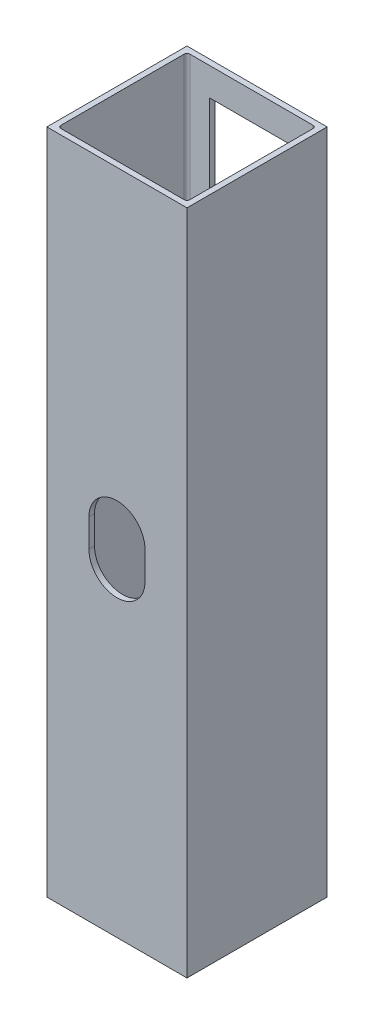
ISO-10303-21;
HEADER;
FILE_DESCRIPTION(('STEP AP214'),'2;1');
FILE_NAME('part.step','',(''),(''),'','','');
FILE_SCHEMA(('AUTOMOTIVE_DESIGN { 1 0 10303 214 1 1 1 1 }'));
ENDSEC;
DATA;
#1=APPLICATION_CONTEXT('core data for automotive mechanical design processes');
#2=APPLICATION_PROTOCOL_DEFINITION('international standard','automotive_design',2000,#1);
#3=PRODUCT_CONTEXT('',#1,'mechanical');
#4=PRODUCT('Part','Part','',(#3));
#5=PRODUCT_RELATED_PRODUCT_CATEGORY('part','',(#4));
#6=PRODUCT_DEFINITION_FORMATION('','',#4);
#7=PRODUCT_DEFINITION_CONTEXT('part definition',#1,'design');
#8=PRODUCT_DEFINITION('design','',#6,#7);
#9=PRODUCT_DEFINITION_SHAPE('','',#8);
#10=(LENGTH_UNIT() NAMED_UNIT(*) SI_UNIT(.MILLI.,.METRE.));
#11=(NAMED_UNIT(*) PLANE_ANGLE_UNIT() SI_UNIT($,.RADIAN.));
#12=(NAMED_UNIT(*) SI_UNIT($,.STERADIAN.) SOLID_ANGLE_UNIT());
#13=UNCERTAINTY_MEASURE_WITH_UNIT(LENGTH_MEASURE(1.E-05),#10,'distance_accuracy_value','');
#14=(GEOMETRIC_REPRESENTATION_CONTEXT(3) GLOBAL_UNCERTAINTY_ASSIGNED_CONTEXT((#13)) GLOBAL_UNIT_ASSIGNED_CONTEXT((#10,
#11,#12)) REPRESENTATION_CONTEXT('',''));
#15=CARTESIAN_POINT('',(0.,0.,0.));
#16=DIRECTION('',(0.,0.,1.));
#17=DIRECTION('',(1.,0.,0.));
#18=AXIS2_PLACEMENT_3D('',#15,#16,#17);
#19=CARTESIAN_POINT('',(0.,-304.8,0.));
#20=DIRECTION('',(0.,0.,1.));
#21=DIRECTION('',(1.,0.,0.));
#22=AXIS2_PLACEMENT_3D('',#19,#20,#21);
#23=PLANE('',#22);
#24=DIRECTION('',(1.,0.,0.));
#25=VECTOR('',#24,1.);
#26=CARTESIAN_POINT('',(0.,-2.54,0.));
#27=LINE('',#26,#25);
#28=CARTESIAN_POINT('',(0.,-2.5400000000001,0.));
#29=VERTEX_POINT('',#28);
#30=CARTESIAN_POINT('',(63.5,-2.54,0.));
#31=VERTEX_POINT('',#30);
#32=EDGE_CURVE('E281',#29,#31,#27,.T.);
#33=ORIENTED_EDGE('',*,*,#32,.F.);
#34=DIRECTION('',(0.,1.,0.));
#35=VECTOR('',#34,1.);
#36=CARTESIAN_POINT('',(0.,-304.8,0.));
#37=LINE('',#36,#35);
#38=CARTESIAN_POINT('',(0.,-304.8,0.));
#39=VERTEX_POINT('',#38);
#40=EDGE_CURVE('E333',#39,#29,#37,.T.);
#41=ORIENTED_EDGE('',*,*,#40,.F.);
#42=DIRECTION('',(1.,0.,0.));
#43=VECTOR('',#42,1.);
#44=CARTESIAN_POINT('',(0.,-304.8,0.));
#45=LINE('',#44,#43);
#46=CARTESIAN_POINT('',(63.5,-304.8,0.));
#47=VERTEX_POINT('',#46);
#48=EDGE_CURVE('E321',#39,#47,#45,.T.);
#49=ORIENTED_EDGE('',*,*,#48,.T.);
#50=DIRECTION('',(0.,1.,0.));
#51=VECTOR('',#50,1.);
#52=CARTESIAN_POINT('',(63.5,-304.8,0.));
#53=LINE('',#52,#51);
#54=EDGE_CURVE('E343',#47,#31,#53,.T.);
#55=ORIENTED_EDGE('',*,*,#54,.T.);
#56=EDGE_LOOP('',(#33,#41,#49,#55));
#57=FACE_BOUND('',#56,.T.);
#58=CARTESIAN_POINT('',(31.75,-146.05,0.));
#59=DIRECTION('',(0.,0.,1.));
#60=DIRECTION('',(1.,0.,0.));
#61=AXIS2_PLACEMENT_3D('',#58,#59,#60);
#62=CIRCLE('',#61,12.7);
#63=CARTESIAN_POINT('',(44.45,-146.05,0.));
#64=VERTEX_POINT('',#63);
#65=CARTESIAN_POINT('',(19.05,-146.05,0.));
#66=VERTEX_POINT('',#65);
#67=EDGE_CURVE('E228',#64,#66,#62,.T.);
#68=ORIENTED_EDGE('',*,*,#67,.F.);
#69=DIRECTION('',(0.,-1.,0.));
#70=VECTOR('',#69,1.);
#71=CARTESIAN_POINT('',(44.45,0.,0.));
#72=LINE('',#71,#70);
#73=CARTESIAN_POINT('',(44.45,-158.75,0.));
#74=VERTEX_POINT('',#73);
#75=EDGE_CURVE('E255',#64,#74,#72,.T.);
#76=ORIENTED_EDGE('',*,*,#75,.T.);
#77=CARTESIAN_POINT('',(31.75,-158.75,0.));
#78=DIRECTION('',(0.,0.,1.));
#79=DIRECTION('',(1.,0.,0.));
#80=AXIS2_PLACEMENT_3D('',#77,#78,#79);
#81=CIRCLE('',#80,12.7);
#82=CARTESIAN_POINT('',(19.05,-158.75,0.));
#83=VERTEX_POINT('',#82);
#84=EDGE_CURVE('E266',#83,#74,#81,.T.);
#85=ORIENTED_EDGE('',*,*,#84,.F.);
#86=DIRECTION('',(0.,-1.,0.));
#87=VECTOR('',#86,1.);
#88=CARTESIAN_POINT('',(19.05,0.,0.));
#89=LINE('',#88,#87);
#90=EDGE_CURVE('E246',#66,#83,#89,.T.);
#91=ORIENTED_EDGE('',*,*,#90,.F.);
#92=EDGE_LOOP('',(#68,#76,#85,#91));
#93=FACE_BOUND('',#92,.T.);
#94=ADVANCED_FACE('F42',(#57,#93),#23,.T.);
#95=CARTESIAN_POINT('',(0.,-302.26,-2.54));
#96=DIRECTION('',(0.,0.,1.));
#97=DIRECTION('',(1.,0.,0.));
#98=AXIS2_PLACEMENT_3D('',#95,#96,#97);
#99=PLANE('',#98);
#100=DIRECTION('',(1.,0.,0.));
#101=VECTOR('',#100,1.);
#102=CARTESIAN_POINT('',(0.,-302.26,-2.54));
#103=LINE('',#102,#101);
#104=CARTESIAN_POINT('',(3.81,-302.26,-2.54));
#105=VERTEX_POINT('',#104);
#106=CARTESIAN_POINT('',(59.69,-302.26,-2.54));
#107=VERTEX_POINT('',#106);
#108=EDGE_CURVE('E301',#105,#107,#103,.T.);
#109=ORIENTED_EDGE('',*,*,#108,.F.);
#110=DIRECTION('',(0.,1.,0.));
#111=VECTOR('',#110,1.);
#112=CARTESIAN_POINT('',(3.81,-302.26,-2.54));
#113=LINE('',#112,#111);
#114=CARTESIAN_POINT('',(3.81,-2.53999999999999,-2.54));
#115=VERTEX_POINT('',#114);
#116=EDGE_CURVE('E355',#105,#115,#113,.T.);
#117=ORIENTED_EDGE('',*,*,#116,.T.);
#118=DIRECTION('',(1.,0.,0.));
#119=VECTOR('',#118,1.);
#120=CARTESIAN_POINT('',(0.,-2.53999999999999,-2.54));
#121=LINE('',#120,#119);
#122=CARTESIAN_POINT('',(59.69,-2.53999999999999,-2.54));
#123=VERTEX_POINT('',#122);
#124=EDGE_CURVE('E297',#115,#123,#121,.T.);
#125=ORIENTED_EDGE('',*,*,#124,.T.);
#126=DIRECTION('',(0.,1.,0.));
#127=VECTOR('',#126,1.);
#128=CARTESIAN_POINT('',(59.69,-302.26,-2.54));
#129=LINE('',#128,#127);
#130=EDGE_CURVE('E352',#123,#107,#129,.F.);
#131=ORIENTED_EDGE('',*,*,#130,.T.);
#132=EDGE_LOOP('',(#109,#117,#125,#131));
#133=FACE_BOUND('',#132,.T.);
#134=DIRECTION('',(0.,-1.,0.));
#135=VECTOR('',#134,1.);
#136=CARTESIAN_POINT('',(44.45,0.,-2.54));
#137=LINE('',#136,#135);
#138=CARTESIAN_POINT('',(44.45,-146.05,-2.54));
#139=VERTEX_POINT('',#138);
#140=CARTESIAN_POINT('',(44.45,-158.75,-2.54));
#141=VERTEX_POINT('',#140);
#142=EDGE_CURVE('E259',#139,#141,#137,.T.);
#143=ORIENTED_EDGE('',*,*,#142,.F.);
#144=CARTESIAN_POINT('',(31.75,-146.05,-2.54));
#145=DIRECTION('',(0.,0.,1.));
#146=DIRECTION('',(1.,0.,0.));
#147=AXIS2_PLACEMENT_3D('',#144,#145,#146);
#148=CIRCLE('',#147,12.7);
#149=CARTESIAN_POINT('',(19.05,-146.05,-2.54));
#150=VERTEX_POINT('',#149);
#151=EDGE_CURVE('E234',#139,#150,#148,.T.);
#152=ORIENTED_EDGE('',*,*,#151,.T.);
#153=DIRECTION('',(0.,-1.,0.));
#154=VECTOR('',#153,1.);
#155=CARTESIAN_POINT('',(19.05,0.,-2.54));
#156=LINE('',#155,#154);
#157=CARTESIAN_POINT('',(19.05,-158.75,-2.54));
#158=VERTEX_POINT('',#157);
#159=EDGE_CURVE('E250',#150,#158,#156,.T.);
#160=ORIENTED_EDGE('',*,*,#159,.T.);
#161=CARTESIAN_POINT('',(31.75,-158.75,-2.54));
#162=DIRECTION('',(0.,0.,1.));
#163=DIRECTION('',(1.,0.,0.));
#164=AXIS2_PLACEMENT_3D('',#161,#162,#163);
#165=CIRCLE('',#164,12.7);
#166=EDGE_CURVE('E254',#158,#141,#165,.T.);
#167=ORIENTED_EDGE('',*,*,#166,.T.);
#168=EDGE_LOOP('',(#143,#152,#160,#167));
#169=FACE_BOUND('',#168,.T.);
#170=ADVANCED_FACE('F421',(#133,#169),#99,.F.);
#171=CARTESIAN_POINT('',(0.,-304.8,0.));
#172=DIRECTION('',(-1.,0.,0.));
#173=DIRECTION('',(0.,0.,1.));
#174=AXIS2_PLACEMENT_3D('',#171,#172,#173);
#175=PLANE('',#174);
#176=DIRECTION('',(0.,0.,1.));
#177=VECTOR('',#176,1.);
#178=CARTESIAN_POINT('',(0.,-2.54,0.));
#179=LINE('',#178,#177);
#180=CARTESIAN_POINT('',(0.,-2.54,-63.5));
#181=VERTEX_POINT('',#180);
#182=EDGE_CURVE('E276',#181,#29,#179,.T.);
#183=ORIENTED_EDGE('',*,*,#182,.F.);
#184=DIRECTION('',(0.,1.,0.));
#185=VECTOR('',#184,1.);
#186=CARTESIAN_POINT('',(0.,-304.8,-63.5));
#187=LINE('',#186,#185);
#188=CARTESIAN_POINT('',(0.,-304.8,-63.5));
#189=VERTEX_POINT('',#188);
#190=EDGE_CURVE('E334',#189,#181,#187,.T.);
#191=ORIENTED_EDGE('',*,*,#190,.F.);
#192=DIRECTION('',(0.,0.,1.));
#193=VECTOR('',#192,1.);
#194=CARTESIAN_POINT('',(0.,-304.8,0.));
#195=LINE('',#194,#193);
#196=EDGE_CURVE('E317',#189,#39,#195,.T.);
#197=ORIENTED_EDGE('',*,*,#196,.T.);
#198=ORIENTED_EDGE('',*,*,#40,.T.);
#199=EDGE_LOOP('',(#183,#191,#197,#198));
#200=FACE_BOUND('',#199,.T.);
#201=ADVANCED_FACE('F442',(#200),#175,.T.);
#202=CARTESIAN_POINT('',(0.,-304.8,-63.5));
#203=DIRECTION('',(0.,0.,-1.));
#204=DIRECTION('',(-1.,0.,0.));
#205=AXIS2_PLACEMENT_3D('',#202,#203,#204);
#206=PLANE('',#205);
#207=DIRECTION('',(1.,0.,0.));
#208=VECTOR('',#207,1.);
#209=CARTESIAN_POINT('',(0.,-15.24,-63.5));
#210=LINE('',#209,#208);
#211=CARTESIAN_POINT('',(12.7,-15.24,-63.5));
#212=VERTEX_POINT('',#211);
#213=CARTESIAN_POINT('',(50.8,-15.24,-63.5));
#214=VERTEX_POINT('',#213);
#215=EDGE_CURVE('E186',#212,#214,#210,.T.);
#216=ORIENTED_EDGE('',*,*,#215,.F.);
#217=DIRECTION('',(0.,-1.,0.));
#218=VECTOR('',#217,1.);
#219=CARTESIAN_POINT('',(12.7,0.,-63.5));
#220=LINE('',#219,#218);
#221=CARTESIAN_POINT('',(12.7,-292.1,-63.5));
#222=VERTEX_POINT('',#221);
#223=EDGE_CURVE('E206',#212,#222,#220,.T.);
#224=ORIENTED_EDGE('',*,*,#223,.T.);
#225=DIRECTION('',(1.,0.,0.));
#226=VECTOR('',#225,1.);
#227=CARTESIAN_POINT('',(0.,-292.1,-63.5));
#228=LINE('',#227,#226);
#229=CARTESIAN_POINT('',(50.8,-292.1,-63.5));
#230=VERTEX_POINT('',#229);
#231=EDGE_CURVE('E210',#222,#230,#228,.T.);
#232=ORIENTED_EDGE('',*,*,#231,.T.);
#233=DIRECTION('',(0.,-1.,0.));
#234=VECTOR('',#233,1.);
#235=CARTESIAN_POINT('',(50.8,0.,-63.5));
#236=LINE('',#235,#234);
#237=EDGE_CURVE('E219',#214,#230,#236,.T.);
#238=ORIENTED_EDGE('',*,*,#237,.F.);
#239=EDGE_LOOP('',(#216,#224,#232,#238));
#240=FACE_BOUND('',#239,.T.);
#241=DIRECTION('',(-1.,0.,0.));
#242=VECTOR('',#241,1.);
#243=CARTESIAN_POINT('',(0.,-2.54,-63.5));
#244=LINE('',#243,#242);
#245=CARTESIAN_POINT('',(63.5,-2.54,-63.5));
#246=VERTEX_POINT('',#245);
#247=EDGE_CURVE('E287',#246,#181,#244,.T.);
#248=ORIENTED_EDGE('',*,*,#247,.F.);
#249=DIRECTION('',(0.,1.,0.));
#250=VECTOR('',#249,1.);
#251=CARTESIAN_POINT('',(63.5,-304.8,-63.5));
#252=LINE('',#251,#250);
#253=CARTESIAN_POINT('',(63.5,-304.8,-63.5));
#254=VERTEX_POINT('',#253);
#255=EDGE_CURVE('E339',#254,#246,#252,.T.);
#256=ORIENTED_EDGE('',*,*,#255,.F.);
#257=DIRECTION('',(-1.,0.,0.));
#258=VECTOR('',#257,1.);
#259=CARTESIAN_POINT('',(0.,-304.8,-63.5));
#260=LINE('',#259,#258);
#261=EDGE_CURVE('E329',#254,#189,#260,.T.);
#262=ORIENTED_EDGE('',*,*,#261,.T.);
#263=ORIENTED_EDGE('',*,*,#190,.T.);
#264=EDGE_LOOP('',(#248,#256,#262,#263));
#265=FACE_BOUND('',#264,.T.);
#266=ADVANCED_FACE('F452',(#240,#265),#206,.T.);
#267=CARTESIAN_POINT('',(63.5,-304.8,0.));
#268=DIRECTION('',(1.,0.,0.));
#269=DIRECTION('',(0.,0.,-1.));
#270=AXIS2_PLACEMENT_3D('',#267,#268,#269);
#271=PLANE('',#270);
#272=DIRECTION('',(0.,0.,-1.));
#273=VECTOR('',#272,1.);
#274=CARTESIAN_POINT('',(63.5,-2.54,0.));
#275=LINE('',#274,#273);
#276=EDGE_CURVE('E284',#31,#246,#275,.T.);
#277=ORIENTED_EDGE('',*,*,#276,.F.);
#278=ORIENTED_EDGE('',*,*,#54,.F.);
#279=DIRECTION('',(0.,0.,-1.));
#280=VECTOR('',#279,1.);
#281=CARTESIAN_POINT('',(63.5,-304.8,0.));
#282=LINE('',#281,#280);
#283=EDGE_CURVE('E325',#47,#254,#282,.T.);
#284=ORIENTED_EDGE('',*,*,#283,.T.);
#285=ORIENTED_EDGE('',*,*,#255,.T.);
#286=EDGE_LOOP('',(#277,#278,#284,#285));
#287=FACE_BOUND('',#286,.T.);
#288=ADVANCED_FACE('F448',(#287),#271,.T.);
#289=CARTESIAN_POINT('',(0.,-304.8,0.));
#290=DIRECTION('',(0.,-1.,0.));
#291=DIRECTION('',(0.,0.,-1.));
#292=AXIS2_PLACEMENT_3D('',#289,#290,#291);
#293=PLANE('',#292);
#294=ORIENTED_EDGE('',*,*,#196,.F.);
#295=ORIENTED_EDGE('',*,*,#261,.F.);
#296=ORIENTED_EDGE('',*,*,#283,.F.);
#297=ORIENTED_EDGE('',*,*,#48,.F.);
#298=EDGE_LOOP('',(#294,#295,#296,#297));
#299=FACE_BOUND('',#298,.T.);
#300=ADVANCED_FACE('F488',(#299),#293,.T.);
#301=CARTESIAN_POINT('',(0.,-2.54,0.));
#302=DIRECTION('',(0.,-1.,0.));
#303=DIRECTION('',(0.,0.,-1.));
#304=AXIS2_PLACEMENT_3D('',#301,#302,#303);
#305=PLANE('',#304);
#306=ORIENTED_EDGE('',*,*,#182,.T.);
#307=ORIENTED_EDGE('',*,*,#32,.T.);
#308=ORIENTED_EDGE('',*,*,#276,.T.);
#309=ORIENTED_EDGE('',*,*,#247,.T.);
#310=EDGE_LOOP('',(#306,#307,#308,#309));
#311=FACE_BOUND('',#310,.T.);
#312=ORIENTED_EDGE('',*,*,#124,.F.);
#313=CARTESIAN_POINT('',(3.81,-2.53999999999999,-3.81));
#314=DIRECTION('',(0.,-1.,0.));
#315=DIRECTION('',(0.,0.,-1.));
#316=AXIS2_PLACEMENT_3D('',#313,#314,#315);
#317=CIRCLE('',#316,1.27);
#318=CARTESIAN_POINT('',(2.54,-2.53999999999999,-3.81));
#319=VERTEX_POINT('',#318);
#320=EDGE_CURVE('E391',#115,#319,#317,.T.);
#321=ORIENTED_EDGE('',*,*,#320,.T.);
#322=DIRECTION('',(0.,0.,-1.));
#323=VECTOR('',#322,1.);
#324=CARTESIAN_POINT('',(2.54,-2.53999999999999,0.));
#325=LINE('',#324,#323);
#326=CARTESIAN_POINT('',(2.54,-2.53999999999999,-59.69));
#327=VERTEX_POINT('',#326);
#328=EDGE_CURVE('E293',#319,#327,#325,.T.);
#329=ORIENTED_EDGE('',*,*,#328,.T.);
#330=CARTESIAN_POINT('',(3.81,-2.53999999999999,-59.69));
#331=DIRECTION('',(0.,-1.,0.));
#332=DIRECTION('',(0.,0.,-1.));
#333=AXIS2_PLACEMENT_3D('',#330,#331,#332);
#334=CIRCLE('',#333,1.27);
#335=CARTESIAN_POINT('',(3.81,-2.53999999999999,-60.96));
#336=VERTEX_POINT('',#335);
#337=EDGE_CURVE('E394',#327,#336,#334,.T.);
#338=ORIENTED_EDGE('',*,*,#337,.T.);
#339=DIRECTION('',(1.,0.,0.));
#340=VECTOR('',#339,1.);
#341=CARTESIAN_POINT('',(0.,-2.53999999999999,-60.96));
#342=LINE('',#341,#340);
#343=CARTESIAN_POINT('',(59.69,-2.53999999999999,-60.96));
#344=VERTEX_POINT('',#343);
#345=EDGE_CURVE('E290',#336,#344,#342,.T.);
#346=ORIENTED_EDGE('',*,*,#345,.T.);
#347=CARTESIAN_POINT('',(59.69,-2.53999999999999,-59.69));
#348=DIRECTION('',(0.,-1.,0.));
#349=DIRECTION('',(0.,0.,-1.));
#350=AXIS2_PLACEMENT_3D('',#347,#348,#349);
#351=CIRCLE('',#350,1.27);
#352=CARTESIAN_POINT('',(60.96,-2.53999999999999,-59.69));
#353=VERTEX_POINT('',#352);
#354=EDGE_CURVE('E51',#344,#353,#351,.T.);
#355=ORIENTED_EDGE('',*,*,#354,.T.);
#356=DIRECTION('',(0.,0.,-1.));
#357=VECTOR('',#356,1.);
#358=CARTESIAN_POINT('',(60.96,-2.53999999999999,0.));
#359=LINE('',#358,#357);
#360=CARTESIAN_POINT('',(60.96,-2.53999999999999,-3.81));
#361=VERTEX_POINT('',#360);
#362=EDGE_CURVE('E338',#361,#353,#359,.T.);
#363=ORIENTED_EDGE('',*,*,#362,.F.);
#364=CARTESIAN_POINT('',(59.69,-2.53999999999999,-3.81));
#365=DIRECTION('',(0.,-1.,0.));
#366=DIRECTION('',(0.,0.,-1.));
#367=AXIS2_PLACEMENT_3D('',#364,#365,#366);
#368=CIRCLE('',#367,1.27);
#369=EDGE_CURVE('E11',#361,#123,#368,.T.);
#370=ORIENTED_EDGE('',*,*,#369,.T.);
#371=EDGE_LOOP('',(#312,#321,#329,#338,#346,#355,#363,#370));
#372=FACE_BOUND('',#371,.T.);
#373=ADVANCED_FACE('F399',(#311,#372),#305,.F.);
#374=CARTESIAN_POINT('',(0.,-302.26,0.));
#375=DIRECTION('',(0.,1.,0.));
#376=DIRECTION('',(0.,0.,1.));
#377=AXIS2_PLACEMENT_3D('',#374,#375,#376);
#378=PLANE('',#377);
#379=DIRECTION('',(0.,0.,-1.));
#380=VECTOR('',#379,1.);
#381=CARTESIAN_POINT('',(2.54,-302.26,0.));
#382=LINE('',#381,#380);
#383=CARTESIAN_POINT('',(2.54,-302.26,-3.81));
#384=VERTEX_POINT('',#383);
#385=CARTESIAN_POINT('',(2.54,-302.26,-59.69));
#386=VERTEX_POINT('',#385);
#387=EDGE_CURVE('E313',#384,#386,#382,.T.);
#388=ORIENTED_EDGE('',*,*,#387,.F.);
#389=CARTESIAN_POINT('',(3.81,-302.26,-3.81));
#390=DIRECTION('',(0.,1.,0.));
#391=DIRECTION('',(0.,0.,1.));
#392=AXIS2_PLACEMENT_3D('',#389,#390,#391);
#393=CIRCLE('',#392,1.27);
#394=EDGE_CURVE('E375',#384,#105,#393,.T.);
#395=ORIENTED_EDGE('',*,*,#394,.T.);
#396=ORIENTED_EDGE('',*,*,#108,.T.);
#397=CARTESIAN_POINT('',(59.69,-302.26,-3.81));
#398=DIRECTION('',(0.,1.,0.));
#399=DIRECTION('',(0.,0.,1.));
#400=AXIS2_PLACEMENT_3D('',#397,#398,#399);
#401=CIRCLE('',#400,1.27);
#402=CARTESIAN_POINT('',(60.96,-302.26,-3.81));
#403=VERTEX_POINT('',#402);
#404=EDGE_CURVE('E366',#107,#403,#401,.T.);
#405=ORIENTED_EDGE('',*,*,#404,.T.);
#406=DIRECTION('',(0.,0.,-1.));
#407=VECTOR('',#406,1.);
#408=CARTESIAN_POINT('',(60.96,-302.26,0.));
#409=LINE('',#408,#407);
#410=CARTESIAN_POINT('',(60.96,-302.26,-59.69));
#411=VERTEX_POINT('',#410);
#412=EDGE_CURVE('E305',#403,#411,#409,.T.);
#413=ORIENTED_EDGE('',*,*,#412,.T.);
#414=CARTESIAN_POINT('',(59.69,-302.26,-59.69));
#415=DIRECTION('',(0.,1.,0.));
#416=DIRECTION('',(0.,0.,1.));
#417=AXIS2_PLACEMENT_3D('',#414,#415,#416);
#418=CIRCLE('',#417,1.27);
#419=CARTESIAN_POINT('',(59.69,-302.26,-60.96));
#420=VERTEX_POINT('',#419);
#421=EDGE_CURVE('E369',#411,#420,#418,.T.);
#422=ORIENTED_EDGE('',*,*,#421,.T.);
#423=DIRECTION('',(1.,0.,0.));
#424=VECTOR('',#423,1.);
#425=CARTESIAN_POINT('',(0.,-302.26,-60.96));
#426=LINE('',#425,#424);
#427=CARTESIAN_POINT('',(3.81,-302.26,-60.96));
#428=VERTEX_POINT('',#427);
#429=EDGE_CURVE('E309',#428,#420,#426,.T.);
#430=ORIENTED_EDGE('',*,*,#429,.F.);
#431=CARTESIAN_POINT('',(3.81,-302.26,-59.69));
#432=DIRECTION('',(0.,1.,0.));
#433=DIRECTION('',(0.,0.,1.));
#434=AXIS2_PLACEMENT_3D('',#431,#432,#433);
#435=CIRCLE('',#434,1.27);
#436=EDGE_CURVE('E372',#428,#386,#435,.T.);
#437=ORIENTED_EDGE('',*,*,#436,.T.);
#438=EDGE_LOOP('',(#388,#395,#396,#405,#413,#422,#430,#437));
#439=FACE_BOUND('',#438,.T.);
#440=ADVANCED_FACE('F410',(#439),#378,.T.);
#441=CARTESIAN_POINT('',(60.96,-302.26,0.));
#442=DIRECTION('',(1.,0.,0.));
#443=DIRECTION('',(0.,0.,-1.));
#444=AXIS2_PLACEMENT_3D('',#441,#442,#443);
#445=PLANE('',#444);
#446=ORIENTED_EDGE('',*,*,#362,.T.);
#447=DIRECTION('',(0.,1.,0.));
#448=VECTOR('',#447,1.);
#449=CARTESIAN_POINT('',(60.96,-302.26,-59.69));
#450=LINE('',#449,#448);
#451=EDGE_CURVE('E388',#353,#411,#450,.F.);
#452=ORIENTED_EDGE('',*,*,#451,.T.);
#453=ORIENTED_EDGE('',*,*,#412,.F.);
#454=DIRECTION('',(0.,1.,0.));
#455=VECTOR('',#454,1.);
#456=CARTESIAN_POINT('',(60.96,-2.53999999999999,-3.81));
#457=LINE('',#456,#455);
#458=EDGE_CURVE('E385',#403,#361,#457,.T.);
#459=ORIENTED_EDGE('',*,*,#458,.T.);
#460=EDGE_LOOP('',(#446,#452,#453,#459));
#461=FACE_BOUND('',#460,.T.);
#462=ADVANCED_FACE('F426',(#461),#445,.F.);
#463=CARTESIAN_POINT('',(0.,-302.26,-60.96));
#464=DIRECTION('',(0.,0.,1.));
#465=DIRECTION('',(1.,0.,0.));
#466=AXIS2_PLACEMENT_3D('',#463,#464,#465);
#467=PLANE('',#466);
#468=DIRECTION('',(1.,0.,0.));
#469=VECTOR('',#468,1.);
#470=CARTESIAN_POINT('',(0.,-15.24,-60.96));
#471=LINE('',#470,#469);
#472=CARTESIAN_POINT('',(12.7,-15.24,-60.96));
#473=VERTEX_POINT('',#472);
#474=CARTESIAN_POINT('',(50.8,-15.24,-60.96));
#475=VERTEX_POINT('',#474);
#476=EDGE_CURVE('E183',#473,#475,#471,.T.);
#477=ORIENTED_EDGE('',*,*,#476,.T.);
#478=DIRECTION('',(0.,-1.,0.));
#479=VECTOR('',#478,1.);
#480=CARTESIAN_POINT('',(50.8,0.,-60.96));
#481=LINE('',#480,#479);
#482=CARTESIAN_POINT('',(50.8,-292.1,-60.96));
#483=VERTEX_POINT('',#482);
#484=EDGE_CURVE('E195',#475,#483,#481,.T.);
#485=ORIENTED_EDGE('',*,*,#484,.T.);
#486=DIRECTION('',(1.,0.,0.));
#487=VECTOR('',#486,1.);
#488=CARTESIAN_POINT('',(0.,-292.1,-60.96));
#489=LINE('',#488,#487);
#490=CARTESIAN_POINT('',(12.7,-292.1,-60.96));
#491=VERTEX_POINT('',#490);
#492=EDGE_CURVE('E201',#491,#483,#489,.T.);
#493=ORIENTED_EDGE('',*,*,#492,.F.);
#494=DIRECTION('',(0.,-1.,0.));
#495=VECTOR('',#494,1.);
#496=CARTESIAN_POINT('',(12.7,0.,-60.96));
#497=LINE('',#496,#495);
#498=EDGE_CURVE('E192',#473,#491,#497,.T.);
#499=ORIENTED_EDGE('',*,*,#498,.F.);
#500=EDGE_LOOP('',(#477,#485,#493,#499));
#501=FACE_BOUND('',#500,.T.);
#502=ORIENTED_EDGE('',*,*,#345,.F.);
#503=DIRECTION('',(0.,1.,0.));
#504=VECTOR('',#503,1.);
#505=CARTESIAN_POINT('',(3.81,-302.26,-60.96));
#506=LINE('',#505,#504);
#507=EDGE_CURVE('E382',#336,#428,#506,.F.);
#508=ORIENTED_EDGE('',*,*,#507,.T.);
#509=ORIENTED_EDGE('',*,*,#429,.T.);
#510=DIRECTION('',(0.,1.,0.));
#511=VECTOR('',#510,1.);
#512=CARTESIAN_POINT('',(59.69,-302.26,-60.96));
#513=LINE('',#512,#511);
#514=EDGE_CURVE('E378',#420,#344,#513,.T.);
#515=ORIENTED_EDGE('',*,*,#514,.T.);
#516=EDGE_LOOP('',(#502,#508,#509,#515));
#517=FACE_BOUND('',#516,.T.);
#518=ADVANCED_FACE('F203',(#501,#517),#467,.T.);
#519=CARTESIAN_POINT('',(2.54,-302.26,0.));
#520=DIRECTION('',(1.,0.,0.));
#521=DIRECTION('',(0.,0.,-1.));
#522=AXIS2_PLACEMENT_3D('',#519,#520,#521);
#523=PLANE('',#522);
#524=ORIENTED_EDGE('',*,*,#328,.F.);
#525=DIRECTION('',(0.,1.,0.));
#526=VECTOR('',#525,1.);
#527=CARTESIAN_POINT('',(2.54,-302.26,-3.81));
#528=LINE('',#527,#526);
#529=EDGE_CURVE('E363',#319,#384,#528,.F.);
#530=ORIENTED_EDGE('',*,*,#529,.T.);
#531=ORIENTED_EDGE('',*,*,#387,.T.);
#532=DIRECTION('',(0.,1.,0.));
#533=VECTOR('',#532,1.);
#534=CARTESIAN_POINT('',(2.54,-2.53999999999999,-59.69));
#535=LINE('',#534,#533);
#536=EDGE_CURVE('E359',#386,#327,#535,.T.);
#537=ORIENTED_EDGE('',*,*,#536,.T.);
#538=EDGE_LOOP('',(#524,#530,#531,#537));
#539=FACE_BOUND('',#538,.T.);
#540=ADVANCED_FACE('F413',(#539),#523,.T.);
#541=CARTESIAN_POINT('',(19.05,0.,-2.54));
#542=DIRECTION('',(-1.,0.,0.));
#543=DIRECTION('',(0.,0.,1.));
#544=AXIS2_PLACEMENT_3D('',#541,#542,#543);
#545=PLANE('',#544);
#546=ORIENTED_EDGE('',*,*,#90,.T.);
#547=DIRECTION('',(0.,0.,1.));
#548=VECTOR('',#547,1.);
#549=CARTESIAN_POINT('',(19.05,-158.75,-2.54));
#550=LINE('',#549,#548);
#551=EDGE_CURVE('E262',#158,#83,#550,.T.);
#552=ORIENTED_EDGE('',*,*,#551,.F.);
#553=ORIENTED_EDGE('',*,*,#159,.F.);
#554=DIRECTION('',(0.,0.,1.));
#555=VECTOR('',#554,1.);
#556=CARTESIAN_POINT('',(19.05,-146.05,-2.54));
#557=LINE('',#556,#555);
#558=EDGE_CURVE('E238',#150,#66,#557,.T.);
#559=ORIENTED_EDGE('',*,*,#558,.T.);
#560=EDGE_LOOP('',(#546,#552,#553,#559));
#561=FACE_BOUND('',#560,.T.);
#562=ADVANCED_FACE('F478',(#561),#545,.F.);
#563=CARTESIAN_POINT('',(44.45,0.,-2.54));
#564=DIRECTION('',(-1.,0.,0.));
#565=DIRECTION('',(0.,0.,1.));
#566=AXIS2_PLACEMENT_3D('',#563,#564,#565);
#567=PLANE('',#566);
#568=ORIENTED_EDGE('',*,*,#75,.F.);
#569=DIRECTION('',(0.,0.,1.));
#570=VECTOR('',#569,1.);
#571=CARTESIAN_POINT('',(44.45,-146.05,-2.54));
#572=LINE('',#571,#570);
#573=EDGE_CURVE('E242',#139,#64,#572,.T.);
#574=ORIENTED_EDGE('',*,*,#573,.F.);
#575=ORIENTED_EDGE('',*,*,#142,.T.);
#576=DIRECTION('',(0.,0.,1.));
#577=VECTOR('',#576,1.);
#578=CARTESIAN_POINT('',(44.45,-158.75,-2.54));
#579=LINE('',#578,#577);
#580=EDGE_CURVE('E273',#141,#74,#579,.T.);
#581=ORIENTED_EDGE('',*,*,#580,.T.);
#582=EDGE_LOOP('',(#568,#574,#575,#581));
#583=FACE_BOUND('',#582,.T.);
#584=ADVANCED_FACE('F475',(#583),#567,.T.);
#585=CARTESIAN_POINT('',(31.75,-158.75,-2.54));
#586=DIRECTION('',(0.,0.,1.));
#587=DIRECTION('',(1.,0.,0.));
#588=AXIS2_PLACEMENT_3D('',#585,#586,#587);
#589=CYLINDRICAL_SURFACE('',#588,12.7);
#590=ORIENTED_EDGE('',*,*,#84,.T.);
#591=ORIENTED_EDGE('',*,*,#580,.F.);
#592=ORIENTED_EDGE('',*,*,#166,.F.);
#593=ORIENTED_EDGE('',*,*,#551,.T.);
#594=EDGE_LOOP('',(#590,#591,#592,#593));
#595=FACE_BOUND('',#594,.T.);
#596=ADVANCED_FACE('F473',(#595),#589,.F.);
#597=CARTESIAN_POINT('',(31.75,-146.05,-2.54));
#598=DIRECTION('',(0.,0.,1.));
#599=DIRECTION('',(1.,0.,0.));
#600=AXIS2_PLACEMENT_3D('',#597,#598,#599);
#601=CYLINDRICAL_SURFACE('',#600,12.7);
#602=ORIENTED_EDGE('',*,*,#67,.T.);
#603=ORIENTED_EDGE('',*,*,#558,.F.);
#604=ORIENTED_EDGE('',*,*,#151,.F.);
#605=ORIENTED_EDGE('',*,*,#573,.T.);
#606=EDGE_LOOP('',(#602,#603,#604,#605));
#607=FACE_BOUND('',#606,.T.);
#608=ADVANCED_FACE('F470',(#607),#601,.F.);
#609=CARTESIAN_POINT('',(0.,-15.24,-60.96));
#610=DIRECTION('',(0.,1.,0.));
#611=DIRECTION('',(0.,0.,1.));
#612=AXIS2_PLACEMENT_3D('',#609,#610,#611);
#613=PLANE('',#612);
#614=ORIENTED_EDGE('',*,*,#215,.T.);
#615=DIRECTION('',(0.,0.,-1.));
#616=VECTOR('',#615,1.);
#617=CARTESIAN_POINT('',(50.8,-15.24,-60.96));
#618=LINE('',#617,#616);
#619=EDGE_CURVE('E179',#475,#214,#618,.T.);
#620=ORIENTED_EDGE('',*,*,#619,.F.);
#621=ORIENTED_EDGE('',*,*,#476,.F.);
#622=DIRECTION('',(0.,0.,-1.));
#623=VECTOR('',#622,1.);
#624=CARTESIAN_POINT('',(12.7,-15.24,-60.96));
#625=LINE('',#624,#623);
#626=EDGE_CURVE('E225',#473,#212,#625,.T.);
#627=ORIENTED_EDGE('',*,*,#626,.T.);
#628=EDGE_LOOP('',(#614,#620,#621,#627));
#629=FACE_BOUND('',#628,.T.);
#630=ADVANCED_FACE('F181',(#629),#613,.F.);
#631=CARTESIAN_POINT('',(12.7,0.,-60.96));
#632=DIRECTION('',(1.,0.,0.));
#633=DIRECTION('',(0.,0.,-1.));
#634=AXIS2_PLACEMENT_3D('',#631,#632,#633);
#635=PLANE('',#634);
#636=ORIENTED_EDGE('',*,*,#223,.F.);
#637=ORIENTED_EDGE('',*,*,#626,.F.);
#638=ORIENTED_EDGE('',*,*,#498,.T.);
#639=DIRECTION('',(0.,0.,-1.));
#640=VECTOR('',#639,1.);
#641=CARTESIAN_POINT('',(12.7,-292.1,-60.96));
#642=LINE('',#641,#640);
#643=EDGE_CURVE('E229',#491,#222,#642,.T.);
#644=ORIENTED_EDGE('',*,*,#643,.T.);
#645=EDGE_LOOP('',(#636,#637,#638,#644));
#646=FACE_BOUND('',#645,.T.);
#647=ADVANCED_FACE('F463',(#646),#635,.T.);
#648=CARTESIAN_POINT('',(0.,-292.1,-60.96));
#649=DIRECTION('',(0.,1.,0.));
#650=DIRECTION('',(0.,0.,1.));
#651=AXIS2_PLACEMENT_3D('',#648,#649,#650);
#652=PLANE('',#651);
#653=ORIENTED_EDGE('',*,*,#231,.F.);
#654=ORIENTED_EDGE('',*,*,#643,.F.);
#655=ORIENTED_EDGE('',*,*,#492,.T.);
#656=DIRECTION('',(0.,0.,-1.));
#657=VECTOR('',#656,1.);
#658=CARTESIAN_POINT('',(50.8,-292.1,-60.96));
#659=LINE('',#658,#657);
#660=EDGE_CURVE('E191',#483,#230,#659,.T.);
#661=ORIENTED_EDGE('',*,*,#660,.T.);
#662=EDGE_LOOP('',(#653,#654,#655,#661));
#663=FACE_BOUND('',#662,.T.);
#664=ADVANCED_FACE('F458',(#663),#652,.T.);
#665=CARTESIAN_POINT('',(50.8,0.,-60.96));
#666=DIRECTION('',(1.,0.,0.));
#667=DIRECTION('',(0.,0.,-1.));
#668=AXIS2_PLACEMENT_3D('',#665,#666,#667);
#669=PLANE('',#668);
#670=ORIENTED_EDGE('',*,*,#237,.T.);
#671=ORIENTED_EDGE('',*,*,#660,.F.);
#672=ORIENTED_EDGE('',*,*,#484,.F.);
#673=ORIENTED_EDGE('',*,*,#619,.T.);
#674=EDGE_LOOP('',(#670,#671,#672,#673));
#675=FACE_BOUND('',#674,.T.);
#676=ADVANCED_FACE('F196',(#675),#669,.F.);
#677=CARTESIAN_POINT('',(3.81,-302.26,-3.81));
#678=DIRECTION('',(0.,1.,0.));
#679=DIRECTION('',(0.,0.,1.));
#680=AXIS2_PLACEMENT_3D('',#677,#678,#679);
#681=CYLINDRICAL_SURFACE('',#680,1.27);
#682=ORIENTED_EDGE('',*,*,#394,.F.);
#683=ORIENTED_EDGE('',*,*,#529,.F.);
#684=ORIENTED_EDGE('',*,*,#320,.F.);
#685=ORIENTED_EDGE('',*,*,#116,.F.);
#686=EDGE_LOOP('',(#682,#683,#684,#685));
#687=FACE_BOUND('',#686,.T.);
#688=ADVANCED_FACE('F416',(#687),#681,.F.);
#689=CARTESIAN_POINT('',(3.81,-302.26,-59.69));
#690=DIRECTION('',(0.,-1.,0.));
#691=DIRECTION('',(0.,0.,-1.));
#692=AXIS2_PLACEMENT_3D('',#689,#690,#691);
#693=CYLINDRICAL_SURFACE('',#692,1.27);
#694=ORIENTED_EDGE('',*,*,#436,.F.);
#695=ORIENTED_EDGE('',*,*,#507,.F.);
#696=ORIENTED_EDGE('',*,*,#337,.F.);
#697=ORIENTED_EDGE('',*,*,#536,.F.);
#698=EDGE_LOOP('',(#694,#695,#696,#697));
#699=FACE_BOUND('',#698,.T.);
#700=ADVANCED_FACE('F407',(#699),#693,.F.);
#701=CARTESIAN_POINT('',(59.69,-302.26,-59.69));
#702=DIRECTION('',(0.,1.,0.));
#703=DIRECTION('',(0.,0.,1.));
#704=AXIS2_PLACEMENT_3D('',#701,#702,#703);
#705=CYLINDRICAL_SURFACE('',#704,1.27);
#706=ORIENTED_EDGE('',*,*,#421,.F.);
#707=ORIENTED_EDGE('',*,*,#451,.F.);
#708=ORIENTED_EDGE('',*,*,#354,.F.);
#709=ORIENTED_EDGE('',*,*,#514,.F.);
#710=EDGE_LOOP('',(#706,#707,#708,#709));
#711=FACE_BOUND('',#710,.T.);
#712=ADVANCED_FACE('F429',(#711),#705,.F.);
#713=CARTESIAN_POINT('',(59.69,-302.26,-3.81));
#714=DIRECTION('',(0.,-1.,0.));
#715=DIRECTION('',(0.,0.,-1.));
#716=AXIS2_PLACEMENT_3D('',#713,#714,#715);
#717=CYLINDRICAL_SURFACE('',#716,1.27);
#718=ORIENTED_EDGE('',*,*,#404,.F.);
#719=ORIENTED_EDGE('',*,*,#130,.F.);
#720=ORIENTED_EDGE('',*,*,#369,.F.);
#721=ORIENTED_EDGE('',*,*,#458,.F.);
#722=EDGE_LOOP('',(#718,#719,#720,#721));
#723=FACE_BOUND('',#722,.T.);
#724=ADVANCED_FACE('F44',(#723),#717,.F.);
#725=CLOSED_SHELL('',(#94,#170,#201,#266,#288,#300,#373,#440,#462,#518,#540,#562,#584,#596,#608,
#630,#647,#664,#676,#688,#700,#712,#724));
#726=MANIFOLD_SOLID_BREP('B2',#725);
#727=ADVANCED_BREP_SHAPE_REPRESENTATION('',(#18,#726),#14);
#728=SHAPE_DEFINITION_REPRESENTATION(#9,#727);
ENDSEC;
END-ISO-10303-21;
